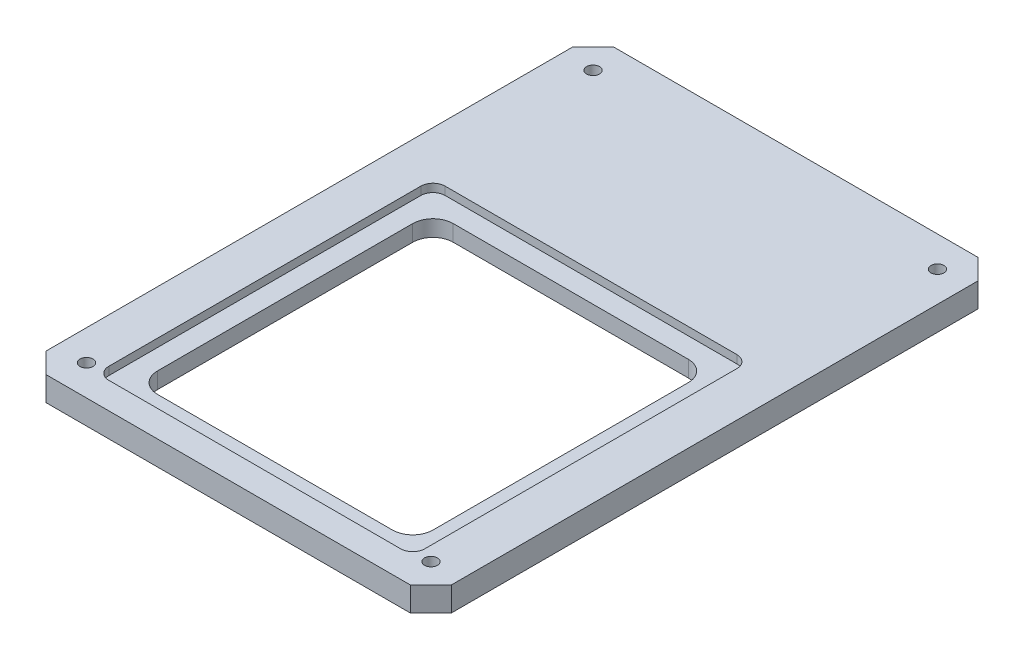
from build123d import *

# Parameters (mm, degrees)
ESQUISSE1_R             = 1.6
EXTRUSION1_DEPTH        = 6
ENL_V_MAT_EXTRU_1_DEPTH = 2


with BuildPart() as part:
    # Esquisse1 → Extrusion1 (new body)
    with BuildSketch(Plane(origin=(0, 0, 0), x_dir=(1, 0, 0), z_dir=(0, 1, 0))):
        Polygon((-2.5, 8.022479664), (2.528447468, 2.971552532), (92.471552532, 2.971552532), (97.5, 8.022479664), (97.5, 137.977520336), (92.471552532, 143.028447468), (2.528447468, 143.028447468), (-2.5, 137.977520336), align=None)
        with Locations(Location((5, 10.5, 0), (0, 0, 270))):
            Circle(ESQUISSE1_R, mode=Mode.SUBTRACT)
        with Locations(Location((90, 10.5, 0), (0, 0, 90))):
            Circle(ESQUISSE1_R, mode=Mode.SUBTRACT)
        with Locations(Location((90, 135.5, 0), (0, 0, 270))):
            Circle(ESQUISSE1_R, mode=Mode.SUBTRACT)
        with Locations(Location((5, 135.5, 0), (0, 0, 90))):
            Circle(ESQUISSE1_R, mode=Mode.SUBTRACT)
        with BuildLine():
            Line((18.5, 87.5), (76.5, 87.5))
            ThreePointArc((76.5, 87.5), (80.035533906, 86.035533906), (81.5, 82.5))
            Line((81.5, 82.5), (81.5, 19.5))
            ThreePointArc((81.5, 19.5), (80.035533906, 15.964466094), (76.5, 14.5))
            Line((76.5, 14.5), (18.5, 14.5))
            ThreePointArc((18.5, 14.5), (14.964466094, 15.964466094), (13.5, 19.5))
            Line((13.5, 19.5), (13.5, 82.5))
            ThreePointArc((13.5, 82.5), (14.964466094, 86.035533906), (18.5, 87.5))
        make_face(mode=Mode.SUBTRACT)
    extrude(amount=EXTRUSION1_DEPTH)

    # Esquisse2 → Enl_v. mat.-Extru.1 (cut)
    with BuildSketch(Plane(origin=(0, 6, 0), x_dir=(-1, 0, 0), z_dir=(0, 1, 0))):
        with BuildLine():
            Line((-11.5, -92.5), (-83.5, -92.5))
            ThreePointArc((-83.5, -92.5), (-85.621320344, -91.621320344), (-86.5, -89.5))
            Line((-86.5, -89.5), (-86.5, -12.5))
            ThreePointArc((-86.5, -12.5), (-85.621320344, -10.378679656), (-83.5, -9.5))
            Line((-83.5, -9.5), (-11.5, -9.5))
            ThreePointArc((-11.5, -9.5), (-9.378679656, -10.378679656), (-8.5, -12.5))
            Line((-8.5, -12.5), (-8.5, -89.5))
            ThreePointArc((-8.5, -89.5), (-9.378679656, -91.621320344), (-11.5, -92.5))
        make_face()
    extrude(amount=-ENL_V_MAT_EXTRU_1_DEPTH, mode=Mode.SUBTRACT)


solid = part.part
